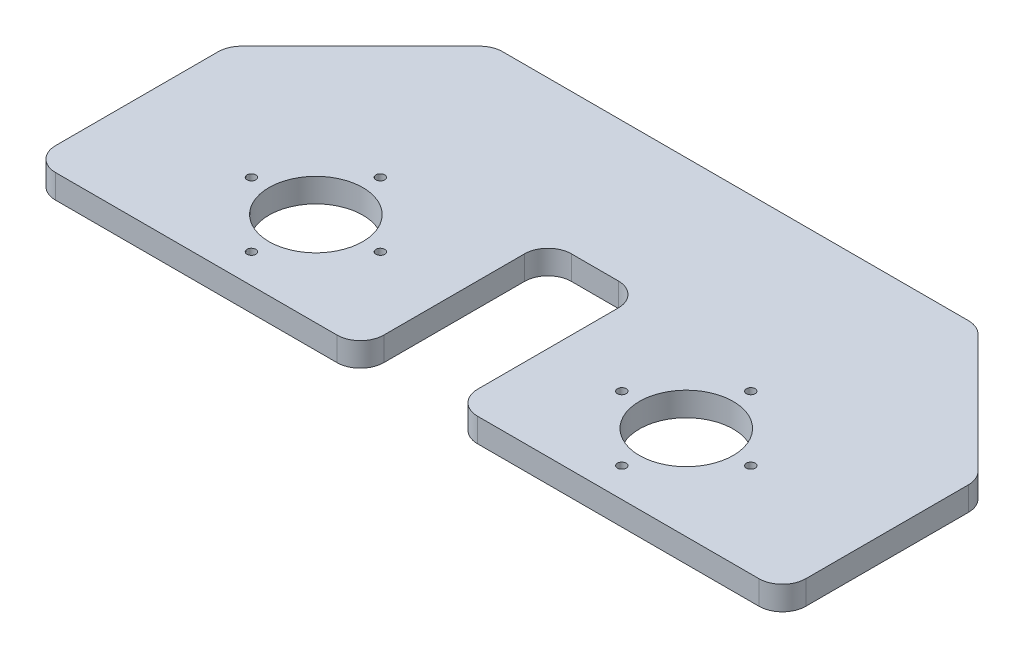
from build123d import *

# Parameters (mm, degrees)
BOSS_EXTRUDE1_DEPTH = 12.954
SKETCH2_R           = 25.4
CUT_EXTRUDE1_DEPTH  = 240.973011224
SKETCH3_R           = 2.3749
CUT_EXTRUDE2_DEPTH  = 6.35
FILLET1_R           = 12.7


with BuildPart() as part:
    # Sketch1 → Boss-Extrude1 (new body)
    with BuildSketch(Plane(origin=(0, 0, 0), x_dir=(1, 0, 0), z_dir=(0, 1, 0))):
        Polygon((-203.2, -50.8), (-25.4, -50.8), (-25.4, 50.8), (25.4, 50.8), (25.4, -50.8), (203.2, -50.8), (203.2, 55.157951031), (131.357951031, 127), (-131.357951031, 127), (-203.2, 55.157951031), align=None)
    extrude(amount=-BOSS_EXTRUDE1_DEPTH)

    # Sketch2 → Cut-Extrude1 (cut, through all)
    with BuildSketch(Plane(origin=(0, 0, 0), x_dir=(1, 0, 0), z_dir=(0, 1, 0))):
        with Locations(Location((-100.33, 0, 0), (0, 0, 270))):
            Circle(SKETCH2_R)
        with Locations(Location((100.33, 0, 0), (0, 0, 270))):
            Circle(SKETCH2_R)
    extrude(amount=-CUT_EXTRUDE1_DEPTH, mode=Mode.SUBTRACT)

    # Sketch3 → Cut-Extrude2 (cut)
    with BuildSketch(Plane(origin=(0, 0, 0), x_dir=(1, 0, 0), z_dir=(0, 1, 0))):
        with Locations(Location((-100.33, 34.925, 0), (0, 0, 270))):
            Circle(SKETCH3_R)
        with Locations(Location((-100.33, -34.925, 0), (0, 0, 270))):
            Circle(SKETCH3_R)
        with Locations(Location((-65.405, 0, 0), (0, 0, 270))):
            Circle(SKETCH3_R)
        with Locations(Location((-135.255, 0, 0), (0, 0, 270))):
            Circle(SKETCH3_R)
        with Locations(Location((65.405, 0, 0), (0, 0, 270))):
            Circle(SKETCH3_R)
        with Locations(Location((100.33, 34.925, 0), (0, 0, 270))):
            Circle(SKETCH3_R)
        with Locations(Location((135.255, 0, 0), (0, 0, 270))):
            Circle(SKETCH3_R)
        with Locations(Location((100.33, -34.925, 0), (0, 0, 270))):
            Circle(SKETCH3_R)
    extrude(amount=-CUT_EXTRUDE2_DEPTH, mode=Mode.SUBTRACT)

    # Fillet1
    fillet1_edges = [part.edges().sort_by_distance(p)[0] for p in [
        (-203.2, -6.477, -55.157951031),
        (-131.357951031, -6.477, -127),
        (131.357951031, -6.477, -127),
        (203.2, -6.477, -55.157951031),
        (203.2, -6.477, 50.8),
        (25.4, -6.477, 50.8),
        (25.4, -6.477, -50.8),
        (-25.4, -6.477, -50.8),
        (-25.4, -6.477, 50.8),
        (-203.2, -6.477, 50.8),
    ]]
    fillet(fillet1_edges, radius=FILLET1_R)


solid = part.part
